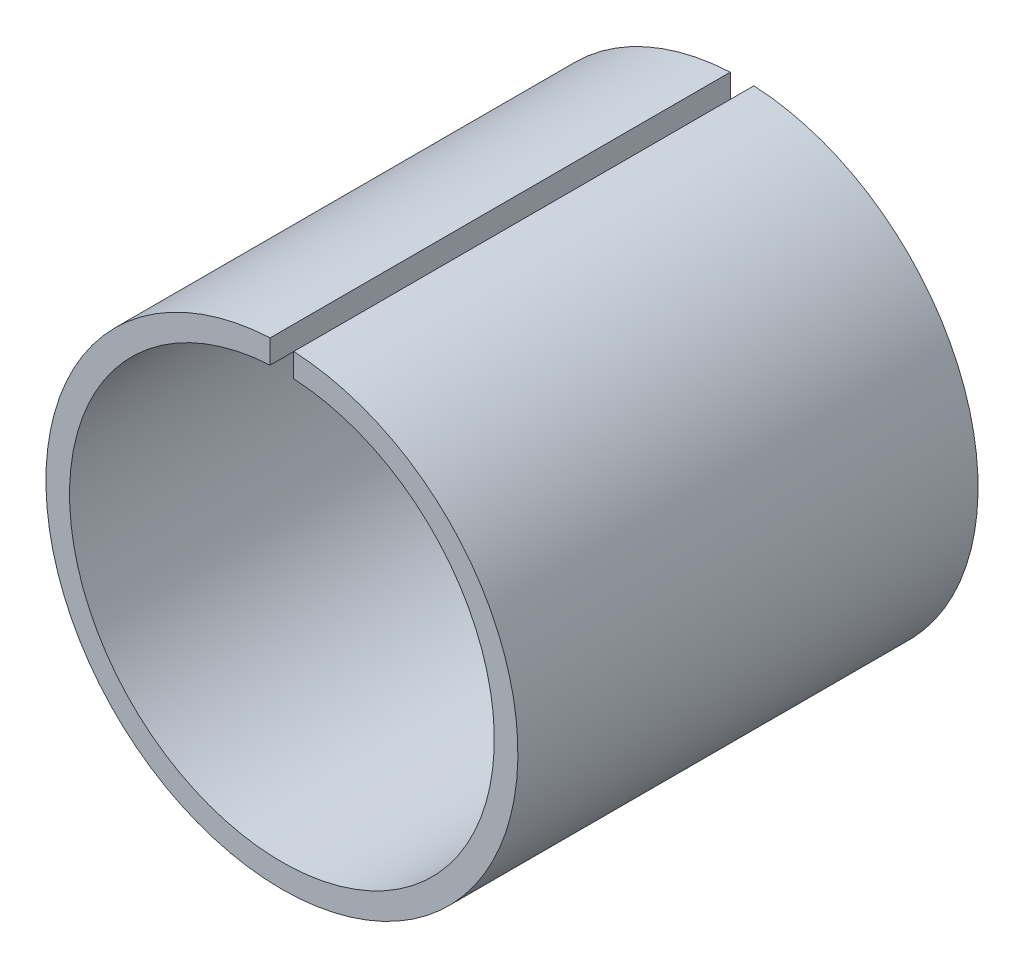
ISO-10303-21;
HEADER;
FILE_DESCRIPTION(('STEP AP214'),'2;1');
FILE_NAME('part.step','',(''),(''),'','','');
FILE_SCHEMA(('AUTOMOTIVE_DESIGN { 1 0 10303 214 1 1 1 1 }'));
ENDSEC;
DATA;
#1=APPLICATION_CONTEXT('core data for automotive mechanical design processes');
#2=APPLICATION_PROTOCOL_DEFINITION('international standard','automotive_design',2000,#1);
#3=PRODUCT_CONTEXT('',#1,'mechanical');
#4=PRODUCT('Part','Part','',(#3));
#5=PRODUCT_RELATED_PRODUCT_CATEGORY('part','',(#4));
#6=PRODUCT_DEFINITION_FORMATION('','',#4);
#7=PRODUCT_DEFINITION_CONTEXT('part definition',#1,'design');
#8=PRODUCT_DEFINITION('design','',#6,#7);
#9=PRODUCT_DEFINITION_SHAPE('','',#8);
#10=(LENGTH_UNIT() NAMED_UNIT(*) SI_UNIT(.MILLI.,.METRE.));
#11=(NAMED_UNIT(*) PLANE_ANGLE_UNIT() SI_UNIT($,.RADIAN.));
#12=(NAMED_UNIT(*) SI_UNIT($,.STERADIAN.) SOLID_ANGLE_UNIT());
#13=UNCERTAINTY_MEASURE_WITH_UNIT(LENGTH_MEASURE(1.E-05),#10,'distance_accuracy_value','');
#14=(GEOMETRIC_REPRESENTATION_CONTEXT(3) GLOBAL_UNCERTAINTY_ASSIGNED_CONTEXT((#13)) GLOBAL_UNIT_ASSIGNED_CONTEXT((#10,
#11,#12)) REPRESENTATION_CONTEXT('',''));
#15=CARTESIAN_POINT('',(0.,0.,0.));
#16=DIRECTION('',(0.,0.,1.));
#17=DIRECTION('',(1.,0.,0.));
#18=AXIS2_PLACEMENT_3D('',#15,#16,#17);
#19=CARTESIAN_POINT('',(0.,0.,0.));
#20=DIRECTION('',(0.,0.,1.));
#21=DIRECTION('',(1.,0.,0.));
#22=AXIS2_PLACEMENT_3D('',#19,#20,#21);
#23=CYLINDRICAL_SURFACE('',#22,9.);
#24=DIRECTION('',(0.,0.,1.));
#25=VECTOR('',#24,1.);
#26=CARTESIAN_POINT('',(0.5,8.98610037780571,0.));
#27=LINE('',#26,#25);
#28=CARTESIAN_POINT('',(0.5,8.98610037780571,-9.75));
#29=VERTEX_POINT('',#28);
#30=CARTESIAN_POINT('',(0.5,8.98610037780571,9.75));
#31=VERTEX_POINT('',#30);
#32=EDGE_CURVE('E56',#29,#31,#27,.T.);
#33=ORIENTED_EDGE('',*,*,#32,.F.);
#34=CARTESIAN_POINT('',(0.,0.,-9.75));
#35=DIRECTION('',(0.,0.,1.));
#36=DIRECTION('',(1.,0.,0.));
#37=AXIS2_PLACEMENT_3D('',#34,#35,#36);
#38=CIRCLE('',#37,9.);
#39=CARTESIAN_POINT('',(-0.5,8.98610037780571,-9.75));
#40=VERTEX_POINT('',#39);
#41=EDGE_CURVE('E78',#29,#40,#38,.F.);
#42=ORIENTED_EDGE('',*,*,#41,.T.);
#43=DIRECTION('',(0.,0.,-1.));
#44=VECTOR('',#43,1.);
#45=CARTESIAN_POINT('',(-0.5,8.98610037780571,0.));
#46=LINE('',#45,#44);
#47=CARTESIAN_POINT('',(-0.5,8.98610037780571,9.75));
#48=VERTEX_POINT('',#47);
#49=EDGE_CURVE('E58',#48,#40,#46,.T.);
#50=ORIENTED_EDGE('',*,*,#49,.F.);
#51=CARTESIAN_POINT('',(0.,0.,9.75));
#52=DIRECTION('',(0.,0.,1.));
#53=DIRECTION('',(1.,0.,0.));
#54=AXIS2_PLACEMENT_3D('',#51,#52,#53);
#55=CIRCLE('',#54,9.);
#56=EDGE_CURVE('E18',#31,#48,#55,.F.);
#57=ORIENTED_EDGE('',*,*,#56,.F.);
#58=EDGE_LOOP('',(#33,#42,#50,#57));
#59=FACE_BOUND('',#58,.T.);
#60=ADVANCED_FACE('F15',(#59),#23,.F.);
#61=CARTESIAN_POINT('',(0.,0.86946293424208,9.75));
#62=DIRECTION('',(0.,0.,1.));
#63=DIRECTION('',(1.,0.,0.));
#64=AXIS2_PLACEMENT_3D('',#61,#62,#63);
#65=PLANE('',#64);
#66=DIRECTION('',(0.,1.,0.));
#67=VECTOR('',#66,1.);
#68=CARTESIAN_POINT('',(-0.5,9.98749217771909,9.75));
#69=LINE('',#68,#67);
#70=CARTESIAN_POINT('',(-0.5,9.98749217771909,9.75));
#71=VERTEX_POINT('',#70);
#72=EDGE_CURVE('E61',#71,#48,#69,.F.);
#73=ORIENTED_EDGE('',*,*,#72,.F.);
#74=CARTESIAN_POINT('',(0.,0.,9.75));
#75=DIRECTION('',(0.,0.,1.));
#76=DIRECTION('',(1.,0.,0.));
#77=AXIS2_PLACEMENT_3D('',#74,#75,#76);
#78=CIRCLE('',#77,10.);
#79=CARTESIAN_POINT('',(0.500000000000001,9.98749217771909,9.75));
#80=VERTEX_POINT('',#79);
#81=EDGE_CURVE('E66',#80,#71,#78,.F.);
#82=ORIENTED_EDGE('',*,*,#81,.F.);
#83=DIRECTION('',(0.,1.,0.));
#84=VECTOR('',#83,1.);
#85=CARTESIAN_POINT('',(0.5,8.98610037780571,9.75));
#86=LINE('',#85,#84);
#87=EDGE_CURVE('E63',#31,#80,#86,.T.);
#88=ORIENTED_EDGE('',*,*,#87,.F.);
#89=ORIENTED_EDGE('',*,*,#56,.T.);
#90=EDGE_LOOP('',(#73,#82,#88,#89));
#91=FACE_BOUND('',#90,.T.);
#92=ADVANCED_FACE('F64',(#91),#65,.T.);
#93=CARTESIAN_POINT('',(-0.5,9.98749217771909,0.));
#94=DIRECTION('',(1.,0.,0.));
#95=DIRECTION('',(0.,0.,-1.));
#96=AXIS2_PLACEMENT_3D('',#93,#94,#95);
#97=PLANE('',#96);
#98=DIRECTION('',(0.,1.,0.));
#99=VECTOR('',#98,1.);
#100=CARTESIAN_POINT('',(-0.5,0.86946293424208,-9.75));
#101=LINE('',#100,#99);
#102=CARTESIAN_POINT('',(-0.5,9.98749217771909,-9.75));
#103=VERTEX_POINT('',#102);
#104=EDGE_CURVE('E68',#40,#103,#101,.T.);
#105=ORIENTED_EDGE('',*,*,#104,.T.);
#106=DIRECTION('',(0.,0.,1.));
#107=VECTOR('',#106,1.);
#108=CARTESIAN_POINT('',(-0.5,9.98749217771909,0.));
#109=LINE('',#108,#107);
#110=EDGE_CURVE('E72',#71,#103,#109,.F.);
#111=ORIENTED_EDGE('',*,*,#110,.F.);
#112=ORIENTED_EDGE('',*,*,#72,.T.);
#113=ORIENTED_EDGE('',*,*,#49,.T.);
#114=EDGE_LOOP('',(#105,#111,#112,#113));
#115=FACE_BOUND('',#114,.T.);
#116=ADVANCED_FACE('F86',(#115),#97,.T.);
#117=CARTESIAN_POINT('',(0.,0.86946293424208,-9.75));
#118=DIRECTION('',(0.,0.,1.));
#119=DIRECTION('',(1.,0.,0.));
#120=AXIS2_PLACEMENT_3D('',#117,#118,#119);
#121=PLANE('',#120);
#122=ORIENTED_EDGE('',*,*,#41,.F.);
#123=DIRECTION('',(0.,1.,0.));
#124=VECTOR('',#123,1.);
#125=CARTESIAN_POINT('',(0.5,8.98610037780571,-9.75));
#126=LINE('',#125,#124);
#127=CARTESIAN_POINT('',(0.500000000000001,9.98749217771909,-9.75));
#128=VERTEX_POINT('',#127);
#129=EDGE_CURVE('E33',#128,#29,#126,.F.);
#130=ORIENTED_EDGE('',*,*,#129,.F.);
#131=CARTESIAN_POINT('',(0.,0.,-9.75));
#132=DIRECTION('',(0.,0.,1.));
#133=DIRECTION('',(1.,0.,0.));
#134=AXIS2_PLACEMENT_3D('',#131,#132,#133);
#135=CIRCLE('',#134,10.);
#136=EDGE_CURVE('E24',#103,#128,#135,.T.);
#137=ORIENTED_EDGE('',*,*,#136,.F.);
#138=ORIENTED_EDGE('',*,*,#104,.F.);
#139=EDGE_LOOP('',(#122,#130,#137,#138));
#140=FACE_BOUND('',#139,.T.);
#141=ADVANCED_FACE('F89',(#140),#121,.F.);
#142=CARTESIAN_POINT('',(0.5,8.98610037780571,0.));
#143=DIRECTION('',(-1.,0.,0.));
#144=DIRECTION('',(0.,0.,1.));
#145=AXIS2_PLACEMENT_3D('',#142,#143,#144);
#146=PLANE('',#145);
#147=ORIENTED_EDGE('',*,*,#129,.T.);
#148=ORIENTED_EDGE('',*,*,#32,.T.);
#149=ORIENTED_EDGE('',*,*,#87,.T.);
#150=DIRECTION('',(0.,0.,1.));
#151=VECTOR('',#150,1.);
#152=CARTESIAN_POINT('',(0.500000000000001,9.98749217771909,0.));
#153=LINE('',#152,#151);
#154=EDGE_CURVE('E10',#128,#80,#153,.T.);
#155=ORIENTED_EDGE('',*,*,#154,.F.);
#156=EDGE_LOOP('',(#147,#148,#149,#155));
#157=FACE_BOUND('',#156,.T.);
#158=ADVANCED_FACE('F70',(#157),#146,.T.);
#159=CARTESIAN_POINT('',(0.,0.,0.));
#160=DIRECTION('',(0.,0.,1.));
#161=DIRECTION('',(1.,0.,0.));
#162=AXIS2_PLACEMENT_3D('',#159,#160,#161);
#163=CYLINDRICAL_SURFACE('',#162,10.);
#164=ORIENTED_EDGE('',*,*,#136,.T.);
#165=ORIENTED_EDGE('',*,*,#154,.T.);
#166=ORIENTED_EDGE('',*,*,#81,.T.);
#167=ORIENTED_EDGE('',*,*,#110,.T.);
#168=EDGE_LOOP('',(#164,#165,#166,#167));
#169=FACE_BOUND('',#168,.T.);
#170=ADVANCED_FACE('F88',(#169),#163,.T.);
#171=CLOSED_SHELL('',(#60,#92,#116,#141,#158,#170));
#172=MANIFOLD_SOLID_BREP('B1',#171);
#173=ADVANCED_BREP_SHAPE_REPRESENTATION('',(#18,#172),#14);
#174=SHAPE_DEFINITION_REPRESENTATION(#9,#173);
ENDSEC;
END-ISO-10303-21;
